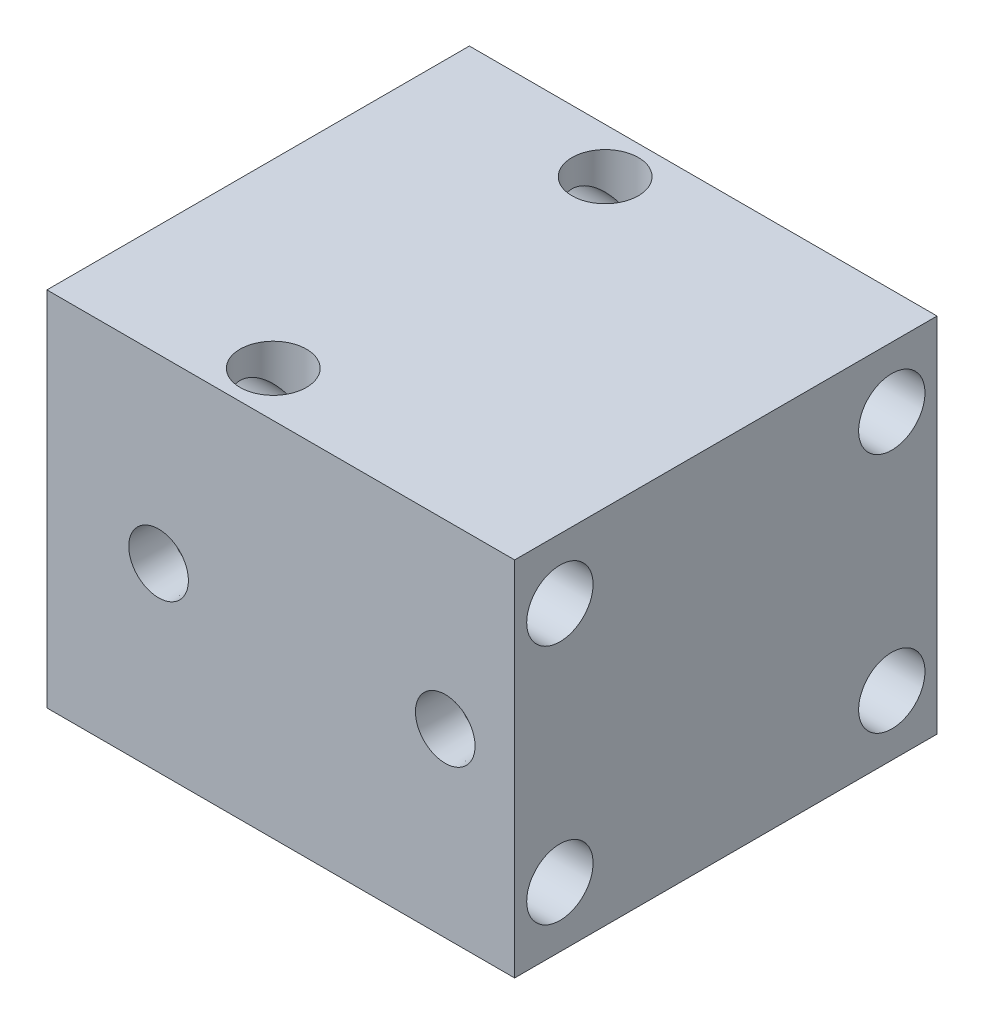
from build123d import *

# Parameters (mm, degrees)
SKETCH1_W                         = 155
SKETCH1_H                         = 140
SKETCH1_R                         = 11
EXTRUDE_H1_DEPTH                  = 120
SKETCH2_R                         = 1.5
CENTER_HOLE_DEPTH                 = 60
F_1_2_NPT_TAPPED_HOLE1_AT_2_COUNT = 2
F_1_2_NPT_TAPPED_HOLE1_AT_2_PITCH = 95
MTG_HOLE_REACH                    = 210.147
SKETCH6_R                         = 11
SKETCH5_R                         = 2
OIL_HOLE_DEPTH                    = 30


with BuildPart() as part:
    # Sketch1 → Extrude H1 (new body)
    with BuildSketch(Plane(origin=(0, 0, 0), x_dir=(1, 0, 0), z_dir=(0, 1, 0))):
        Rectangle(SKETCH1_W, SKETCH1_H)
        with Locations(Location((-17.5, 55, 0), (0, 0, 270))):
            Circle(SKETCH1_R, mode=Mode.SUBTRACT)
        with Locations(Location((-17.5, -55, 0), (0, 0, 270))):
            Circle(SKETCH1_R, mode=Mode.SUBTRACT)
    extrude(amount=EXTRUDE_H1_DEPTH)

    # Sketch2 → CENTER HOLE (cut)
    with BuildSketch(Plane.ZY.offset(77.5)):
        with Locations((0, 60)):
            Circle(SKETCH2_R)
    extrude(amount=-CENTER_HOLE_DEPTH, mode=Mode.SUBTRACT)

    # Sketch3 → 1_2 NPT Tapped Hole1 (revolve, cut)
    with BuildSketch(Plane(origin=(54.5, 60, 70), x_dir=(0, -1, 0), z_dir=(1, 0, 0))):
        Polygon((0, 0), (0, 28.004543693), (8.9281, 22.64), (8.9281, 13.57), (9.479718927, 13.57), (9.8860229, 0), align=None)
    f_1_2_npt_tapped_hole1 = revolve(axis=Axis((54.5, 60, 76.35), (0, 0, -1)), mode=Mode.SUBTRACT)

    # 1_2 NPT Tapped Hole1 at 2: 1_2 NPT Tapped Hole1 ×2
    with Locations(*[(-i * F_1_2_NPT_TAPPED_HOLE1_AT_2_PITCH, 0, 0) for i in range(1, F_1_2_NPT_TAPPED_HOLE1_AT_2_COUNT)]):
        add(f_1_2_npt_tapped_hole1, mode=Mode.SUBTRACT)

    # MTG HOLE: up to this face of the body (flat: up to its plane)
    mtg_hole_end = Plane(part.part.faces().sort_by_distance((77.5, 60, 0))[0])
    # Sketch6 → MTG HOLE (cut, up to the picked face)
    with BuildSketch(Plane.ZY.offset(77.5), mode=Mode.PRIVATE) as mtg_hole_sk1:
        with Locations((-55, 100)):
            Circle(SKETCH6_R)
    mtg_hole_tool1 = split(extrude(mtg_hole_sk1.sketch, amount=-MTG_HOLE_REACH, mode=Mode.PRIVATE), bisect_by=mtg_hole_end, keep=Keep.BOTH, mode=Mode.PRIVATE)
    # Sketch6 → MTG HOLE (cut, up to the picked face)
    with BuildSketch(Plane.ZY.offset(77.5), mode=Mode.PRIVATE) as mtg_hole_sk2:
        with Locations((-55, 20)):
            Circle(SKETCH6_R)
    mtg_hole_tool2 = split(extrude(mtg_hole_sk2.sketch, amount=-MTG_HOLE_REACH, mode=Mode.PRIVATE), bisect_by=mtg_hole_end, keep=Keep.BOTH, mode=Mode.PRIVATE)
    # Sketch6 → MTG HOLE (cut, up to the picked face)
    with BuildSketch(Plane.ZY.offset(77.5), mode=Mode.PRIVATE) as mtg_hole_sk3:
        with Locations((55, 100)):
            Circle(SKETCH6_R)
    mtg_hole_tool3 = split(extrude(mtg_hole_sk3.sketch, amount=-MTG_HOLE_REACH, mode=Mode.PRIVATE), bisect_by=mtg_hole_end, keep=Keep.BOTH, mode=Mode.PRIVATE)
    # Sketch6 → MTG HOLE (cut, up to the picked face)
    with BuildSketch(Plane.ZY.offset(77.5), mode=Mode.PRIVATE) as mtg_hole_sk4:
        with Locations((55, 20)):
            Circle(SKETCH6_R)
    mtg_hole_tool4 = split(extrude(mtg_hole_sk4.sketch, amount=-MTG_HOLE_REACH, mode=Mode.PRIVATE), bisect_by=mtg_hole_end, keep=Keep.BOTH, mode=Mode.PRIVATE)
    add(mtg_hole_tool1.solids().sort_by(Axis((-77.5, 100, -55), (1, 0, 0)))[0], mode=Mode.SUBTRACT)
    add(mtg_hole_tool2.solids().sort_by(Axis((-77.5, 20, -55), (1, 0, 0)))[0], mode=Mode.SUBTRACT)
    add(mtg_hole_tool3.solids().sort_by(Axis((-77.5, 100, 55), (1, 0, 0)))[0], mode=Mode.SUBTRACT)
    add(mtg_hole_tool4.solids().sort_by(Axis((-77.5, 20, 55), (1, 0, 0)))[0], mode=Mode.SUBTRACT)

    # Sketch5 → OIL HOLE (cut)
    with BuildSketch(Plane.XY.offset(70)):
        with Locations((-40.5, 60)):
            Circle(SKETCH5_R)
        with Locations((54.5, 60)):
            Circle(SKETCH5_R)
    extrude(amount=-OIL_HOLE_DEPTH, mode=Mode.SUBTRACT)


solid = part.part
